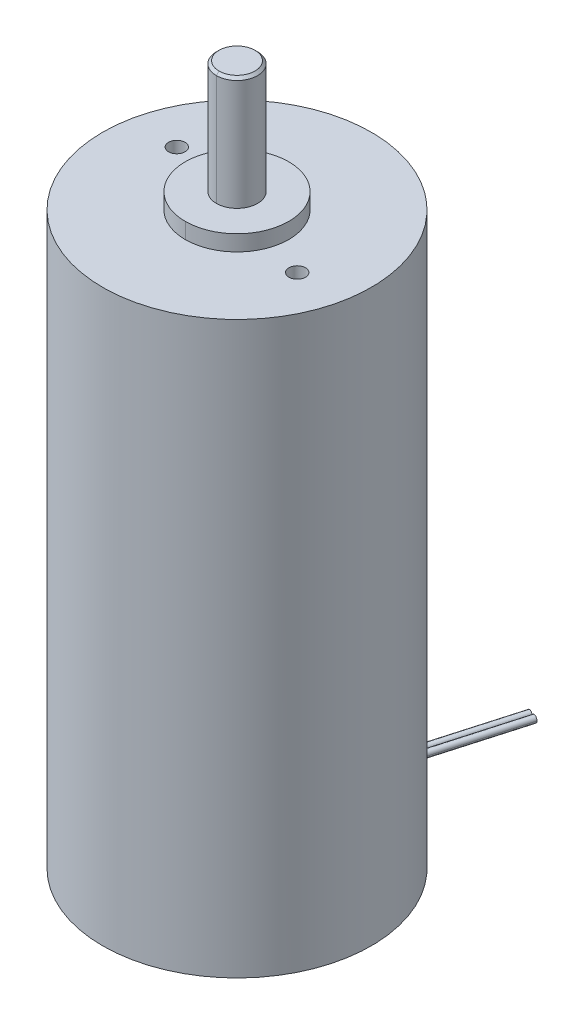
ISO-10303-21;
HEADER;
FILE_DESCRIPTION(('STEP AP214'),'2;1');
FILE_NAME('part.step','',(''),(''),'','','');
FILE_SCHEMA(('AUTOMOTIVE_DESIGN { 1 0 10303 214 1 1 1 1 }'));
ENDSEC;
DATA;
#1=APPLICATION_CONTEXT('core data for automotive mechanical design processes');
#2=APPLICATION_PROTOCOL_DEFINITION('international standard','automotive_design',2000,#1);
#3=PRODUCT_CONTEXT('',#1,'mechanical');
#4=PRODUCT('Part','Part','',(#3));
#5=PRODUCT_RELATED_PRODUCT_CATEGORY('part','',(#4));
#6=PRODUCT_DEFINITION_FORMATION('','',#4);
#7=PRODUCT_DEFINITION_CONTEXT('part definition',#1,'design');
#8=PRODUCT_DEFINITION('design','',#6,#7);
#9=PRODUCT_DEFINITION_SHAPE('','',#8);
#10=(LENGTH_UNIT() NAMED_UNIT(*) SI_UNIT(.MILLI.,.METRE.));
#11=(NAMED_UNIT(*) PLANE_ANGLE_UNIT() SI_UNIT($,.RADIAN.));
#12=(NAMED_UNIT(*) SI_UNIT($,.STERADIAN.) SOLID_ANGLE_UNIT());
#13=UNCERTAINTY_MEASURE_WITH_UNIT(LENGTH_MEASURE(1.E-05),#10,'distance_accuracy_value','');
#14=(GEOMETRIC_REPRESENTATION_CONTEXT(3) GLOBAL_UNCERTAINTY_ASSIGNED_CONTEXT((#13)) GLOBAL_UNIT_ASSIGNED_CONTEXT((#10,
#11,#12)) REPRESENTATION_CONTEXT('',''));
#15=CARTESIAN_POINT('',(0.,0.,0.));
#16=DIRECTION('',(0.,0.,1.));
#17=DIRECTION('',(1.,0.,0.));
#18=AXIS2_PLACEMENT_3D('',#15,#16,#17);
#19=CARTESIAN_POINT('',(0.,67.691,0.));
#20=DIRECTION('',(0.,1.,0.));
#21=DIRECTION('',(0.,0.,1.));
#22=AXIS2_PLACEMENT_3D('',#19,#20,#21);
#23=PLANE('',#22);
#24=CARTESIAN_POINT('',(0.,67.6910000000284,0.));
#25=DIRECTION('',(0.,-1.,0.));
#26=DIRECTION('',(0.,0.,-1.));
#27=AXIS2_PLACEMENT_3D('',#24,#25,#26);
#28=CIRCLE('',#27,1.74117000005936);
#29=CARTESIAN_POINT('',(0.,67.6910000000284,1.74117000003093));
#30=VERTEX_POINT('',#29);
#31=CARTESIAN_POINT('',(0.,67.6910000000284,-1.74117000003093));
#32=VERTEX_POINT('',#31);
#33=EDGE_CURVE('E276',#30,#32,#28,.T.);
#34=ORIENTED_EDGE('',*,*,#33,.F.);
#35=CARTESIAN_POINT('',(0.,67.6910000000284,0.));
#36=DIRECTION('',(0.,-1.,0.));
#37=DIRECTION('',(0.,0.,-1.));
#38=AXIS2_PLACEMENT_3D('',#35,#36,#37);
#39=CIRCLE('',#38,1.74117000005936);
#40=EDGE_CURVE('E280',#32,#30,#39,.T.);
#41=ORIENTED_EDGE('',*,*,#40,.F.);
#42=EDGE_LOOP('',(#34,#41));
#43=FACE_BOUND('',#42,.T.);
#44=ADVANCED_FACE('F15',(#43),#23,.T.);
#45=CARTESIAN_POINT('',(0.,67.4370000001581,0.));
#46=DIRECTION('',(0.,-1.,0.));
#47=DIRECTION('',(0.,0.,-1.));
#48=AXIS2_PLACEMENT_3D('',#45,#46,#47);
#49=CONICAL_SURFACE('',#48,1.99516999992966,0.785398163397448);
#50=CARTESIAN_POINT('',(0.,67.437,0.));
#51=DIRECTION('',(0.,-1.,0.));
#52=DIRECTION('',(0.,0.,-1.));
#53=AXIS2_PLACEMENT_3D('',#50,#51,#52);
#54=CIRCLE('',#53,1.99517);
#55=CARTESIAN_POINT('',(0.,67.4370000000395,-1.99516999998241));
#56=VERTEX_POINT('',#55);
#57=CARTESIAN_POINT('',(0.,67.4370000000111,1.99516999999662));
#58=VERTEX_POINT('',#57);
#59=EDGE_CURVE('E286',#56,#58,#54,.T.);
#60=ORIENTED_EDGE('',*,*,#59,.F.);
#61=DIRECTION('',(0.,0.707106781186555,0.70710678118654));
#62=VECTOR('',#61,1.);
#63=CARTESIAN_POINT('',(0.,-498930.56783001,-499000.));
#64=LINE('',#63,#62);
#65=EDGE_CURVE('E277',#32,#56,#64,.F.);
#66=ORIENTED_EDGE('',*,*,#65,.F.);
#67=ORIENTED_EDGE('',*,*,#40,.T.);
#68=DIRECTION('',(0.,0.707106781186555,-0.70710678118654));
#69=VECTOR('',#68,1.);
#70=CARTESIAN_POINT('',(6.11098752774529E-11,-498930.56783001,499000.));
#71=LINE('',#70,#69);
#72=EDGE_CURVE('E273',#58,#30,#71,.T.);
#73=ORIENTED_EDGE('',*,*,#72,.F.);
#74=EDGE_LOOP('',(#60,#66,#67,#73));
#75=FACE_BOUND('',#74,.T.);
#76=ADVANCED_FACE('F229',(#75),#49,.T.);
#77=CARTESIAN_POINT('',(0.,67.4370000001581,0.));
#78=DIRECTION('',(0.,-1.,0.));
#79=DIRECTION('',(0.,0.,-1.));
#80=AXIS2_PLACEMENT_3D('',#77,#78,#79);
#81=CONICAL_SURFACE('',#80,1.99516999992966,0.785398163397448);
#82=ORIENTED_EDGE('',*,*,#65,.T.);
#83=CARTESIAN_POINT('',(0.,67.437,0.));
#84=DIRECTION('',(0.,-1.,0.));
#85=DIRECTION('',(0.,0.,-1.));
#86=AXIS2_PLACEMENT_3D('',#83,#84,#85);
#87=CIRCLE('',#86,1.99517);
#88=EDGE_CURVE('E281',#58,#56,#87,.T.);
#89=ORIENTED_EDGE('',*,*,#88,.F.);
#90=ORIENTED_EDGE('',*,*,#72,.T.);
#91=ORIENTED_EDGE('',*,*,#33,.T.);
#92=EDGE_LOOP('',(#82,#89,#90,#91));
#93=FACE_BOUND('',#92,.T.);
#94=ADVANCED_FACE('F233',(#93),#81,.T.);
#95=CARTESIAN_POINT('',(0.,67.691,0.));
#96=DIRECTION('',(0.,-1.,0.));
#97=DIRECTION('',(0.,0.,-1.));
#98=AXIS2_PLACEMENT_3D('',#95,#96,#97);
#99=CYLINDRICAL_SURFACE('',#98,1.99517);
#100=CARTESIAN_POINT('',(0.,56.7182,0.));
#101=DIRECTION('',(0.,-1.,0.));
#102=DIRECTION('',(0.,0.,-1.));
#103=AXIS2_PLACEMENT_3D('',#100,#101,#102);
#104=CIRCLE('',#103,1.99517);
#105=CARTESIAN_POINT('',(0.,56.7182,-1.99517));
#106=VERTEX_POINT('',#105);
#107=CARTESIAN_POINT('',(0.,56.7182,1.99517));
#108=VERTEX_POINT('',#107);
#109=EDGE_CURVE('E284',#106,#108,#104,.T.);
#110=ORIENTED_EDGE('',*,*,#109,.F.);
#111=DIRECTION('',(0.,-1.,0.));
#112=VECTOR('',#111,1.);
#113=CARTESIAN_POINT('',(0.,67.691,-1.99517));
#114=LINE('',#113,#112);
#115=EDGE_CURVE('E289',#56,#106,#114,.T.);
#116=ORIENTED_EDGE('',*,*,#115,.F.);
#117=ORIENTED_EDGE('',*,*,#59,.T.);
#118=DIRECTION('',(0.,-1.,0.));
#119=VECTOR('',#118,1.);
#120=CARTESIAN_POINT('',(0.,67.691,1.99517));
#121=LINE('',#120,#119);
#122=EDGE_CURVE('E285',#108,#58,#121,.F.);
#123=ORIENTED_EDGE('',*,*,#122,.F.);
#124=EDGE_LOOP('',(#110,#116,#117,#123));
#125=FACE_BOUND('',#124,.T.);
#126=ADVANCED_FACE('F237',(#125),#99,.T.);
#127=CARTESIAN_POINT('',(0.,67.691,0.));
#128=DIRECTION('',(0.,-1.,0.));
#129=DIRECTION('',(0.,0.,-1.));
#130=AXIS2_PLACEMENT_3D('',#127,#128,#129);
#131=CYLINDRICAL_SURFACE('',#130,1.99517);
#132=ORIENTED_EDGE('',*,*,#115,.T.);
#133=CARTESIAN_POINT('',(0.,56.7182,0.));
#134=DIRECTION('',(0.,-1.,0.));
#135=DIRECTION('',(0.,0.,-1.));
#136=AXIS2_PLACEMENT_3D('',#133,#134,#135);
#137=CIRCLE('',#136,1.99517);
#138=EDGE_CURVE('E296',#108,#106,#137,.T.);
#139=ORIENTED_EDGE('',*,*,#138,.F.);
#140=ORIENTED_EDGE('',*,*,#122,.T.);
#141=ORIENTED_EDGE('',*,*,#88,.T.);
#142=EDGE_LOOP('',(#132,#139,#140,#141));
#143=FACE_BOUND('',#142,.T.);
#144=ADVANCED_FACE('F241',(#143),#131,.T.);
#145=CARTESIAN_POINT('',(0.,56.7182,0.));
#146=DIRECTION('',(0.,1.,0.));
#147=DIRECTION('',(0.,0.,1.));
#148=AXIS2_PLACEMENT_3D('',#145,#146,#147);
#149=PLANE('',#148);
#150=ORIENTED_EDGE('',*,*,#109,.T.);
#151=ORIENTED_EDGE('',*,*,#138,.T.);
#152=EDGE_LOOP('',(#150,#151));
#153=FACE_BOUND('',#152,.T.);
#154=CARTESIAN_POINT('',(0.,56.7182,0.));
#155=DIRECTION('',(0.,-1.,0.));
#156=DIRECTION('',(0.,0.,-1.));
#157=AXIS2_PLACEMENT_3D('',#154,#155,#156);
#158=CIRCLE('',#157,5.0038);
#159=CARTESIAN_POINT('',(0.,56.7182,5.0038));
#160=VERTEX_POINT('',#159);
#161=CARTESIAN_POINT('',(0.,56.7182,-5.0038));
#162=VERTEX_POINT('',#161);
#163=EDGE_CURVE('E264',#160,#162,#158,.T.);
#164=ORIENTED_EDGE('',*,*,#163,.F.);
#165=CARTESIAN_POINT('',(0.,56.7182,0.));
#166=DIRECTION('',(0.,-1.,0.));
#167=DIRECTION('',(0.,0.,-1.));
#168=AXIS2_PLACEMENT_3D('',#165,#166,#167);
#169=CIRCLE('',#168,5.0038);
#170=EDGE_CURVE('E266',#162,#160,#169,.T.);
#171=ORIENTED_EDGE('',*,*,#170,.F.);
#172=EDGE_LOOP('',(#164,#171));
#173=FACE_BOUND('',#172,.T.);
#174=ADVANCED_FACE('F245',(#153,#173),#149,.T.);
#175=CARTESIAN_POINT('',(0.,56.7182,0.));
#176=DIRECTION('',(0.,-1.,0.));
#177=DIRECTION('',(0.,0.,-1.));
#178=AXIS2_PLACEMENT_3D('',#175,#176,#177);
#179=CYLINDRICAL_SURFACE('',#178,5.0038);
#180=DIRECTION('',(0.,-1.,0.));
#181=VECTOR('',#180,1.);
#182=CARTESIAN_POINT('',(0.,56.7182,-5.0038));
#183=LINE('',#182,#181);
#184=CARTESIAN_POINT('',(0.,55.1942,-5.0038));
#185=VERTEX_POINT('',#184);
#186=EDGE_CURVE('E260',#185,#162,#183,.F.);
#187=ORIENTED_EDGE('',*,*,#186,.F.);
#188=CARTESIAN_POINT('',(0.,55.1942,0.));
#189=DIRECTION('',(0.,-1.,0.));
#190=DIRECTION('',(0.,0.,-1.));
#191=AXIS2_PLACEMENT_3D('',#188,#189,#190);
#192=CIRCLE('',#191,5.0038);
#193=CARTESIAN_POINT('',(0.,55.1942,5.0038));
#194=VERTEX_POINT('',#193);
#195=EDGE_CURVE('E24',#194,#185,#192,.T.);
#196=ORIENTED_EDGE('',*,*,#195,.F.);
#197=DIRECTION('',(0.,-1.,0.));
#198=VECTOR('',#197,1.);
#199=CARTESIAN_POINT('',(0.,56.7182,5.0038));
#200=LINE('',#199,#198);
#201=EDGE_CURVE('E19',#160,#194,#200,.T.);
#202=ORIENTED_EDGE('',*,*,#201,.F.);
#203=ORIENTED_EDGE('',*,*,#163,.T.);
#204=EDGE_LOOP('',(#187,#196,#202,#203));
#205=FACE_BOUND('',#204,.T.);
#206=ADVANCED_FACE('F248',(#205),#179,.T.);
#207=CARTESIAN_POINT('',(0.,56.7182,0.));
#208=DIRECTION('',(0.,-1.,0.));
#209=DIRECTION('',(0.,0.,-1.));
#210=AXIS2_PLACEMENT_3D('',#207,#208,#209);
#211=CYLINDRICAL_SURFACE('',#210,5.0038);
#212=CARTESIAN_POINT('',(0.,55.1942,0.));
#213=DIRECTION('',(0.,-1.,0.));
#214=DIRECTION('',(0.,0.,-1.));
#215=AXIS2_PLACEMENT_3D('',#212,#213,#214);
#216=CIRCLE('',#215,5.0038);
#217=EDGE_CURVE('E9',#185,#194,#216,.T.);
#218=ORIENTED_EDGE('',*,*,#217,.F.);
#219=ORIENTED_EDGE('',*,*,#186,.T.);
#220=ORIENTED_EDGE('',*,*,#170,.T.);
#221=ORIENTED_EDGE('',*,*,#201,.T.);
#222=EDGE_LOOP('',(#218,#219,#220,#221));
#223=FACE_BOUND('',#222,.T.);
#224=ADVANCED_FACE('F17',(#223),#211,.T.);
#225=CARTESIAN_POINT('',(0.,91.9773290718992,0.));
#226=DIRECTION('',(0.,-1.,0.));
#227=DIRECTION('',(0.,0.,-1.));
#228=AXIS2_PLACEMENT_3D('',#225,#226,#227);
#229=CYLINDRICAL_SURFACE('',#228,13.0048);
#230=CARTESIAN_POINT('',(0.,0.,0.));
#231=DIRECTION('',(0.,1.,0.));
#232=DIRECTION('',(0.,0.,1.));
#233=AXIS2_PLACEMENT_3D('',#230,#231,#232);
#234=CIRCLE('',#233,13.0048);
#235=CARTESIAN_POINT('',(0.,0.,13.0048));
#236=VERTEX_POINT('',#235);
#237=EDGE_CURVE('E309',#236,#236,#234,.F.);
#238=ORIENTED_EDGE('',*,*,#237,.F.);
#239=EDGE_LOOP('',(#238));
#240=FACE_BOUND('',#239,.T.);
#241=CARTESIAN_POINT('',(0.,55.1942,0.));
#242=DIRECTION('',(0.,1.,0.));
#243=DIRECTION('',(-1.,0.,0.));
#244=AXIS2_PLACEMENT_3D('',#241,#242,#243);
#245=CIRCLE('',#244,13.0048);
#246=CARTESIAN_POINT('',(-13.0048,55.1942,0.));
#247=VERTEX_POINT('',#246);
#248=EDGE_CURVE('E306',#247,#247,#245,.T.);
#249=ORIENTED_EDGE('',*,*,#248,.F.);
#250=EDGE_LOOP('',(#249));
#251=FACE_BOUND('',#250,.T.);
#252=CARTESIAN_POINT('',(3.57606223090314,4.82599999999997,-12.503463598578));
#253=CARTESIAN_POINT('',(3.57607669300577,4.84407572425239,-12.5034583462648));
#254=CARTESIAN_POINT('',(3.57459659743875,4.86214686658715,-12.503882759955));
#255=CARTESIAN_POINT('',(3.56875385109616,4.89776514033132,-12.5055521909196));
#256=CARTESIAN_POINT('',(3.56439330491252,4.91531264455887,-12.5067966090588));
#257=CARTESIAN_POINT('',(3.55289326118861,4.94940456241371,-12.5100681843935));
#258=CARTESIAN_POINT('',(3.54575247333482,4.96594850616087,-12.5120957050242));
#259=CARTESIAN_POINT('',(3.52889708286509,4.99755234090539,-12.5168600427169));
#260=CARTESIAN_POINT('',(3.51918298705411,5.01261252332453,-12.5195967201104));
#261=CARTESIAN_POINT('',(3.49745010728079,5.04082476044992,-12.5256853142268));
#262=CARTESIAN_POINT('',(3.48543133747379,5.05397682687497,-12.5290372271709));
#263=CARTESIAN_POINT('',(3.45942350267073,5.07800147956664,-12.5362432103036));
#264=CARTESIAN_POINT('',(3.44543414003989,5.08887372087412,-12.5400973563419));
#265=CARTESIAN_POINT('',(3.41588114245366,5.10802613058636,-12.5481796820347));
#266=CARTESIAN_POINT('',(3.40031774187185,5.11630668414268,-12.5524078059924));
#267=CARTESIAN_POINT('',(3.36805398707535,5.13004274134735,-12.5611032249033));
#268=CARTESIAN_POINT('',(3.35135370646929,5.13549842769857,-12.5655705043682));
#269=CARTESIAN_POINT('',(3.31728637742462,5.14343142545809,-12.5746071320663));
#270=CARTESIAN_POINT('',(3.29991931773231,5.14590868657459,-12.5791764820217));
#271=CARTESIAN_POINT('',(3.26500983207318,5.14781531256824,-12.5882826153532));
#272=CARTESIAN_POINT('',(3.24746740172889,5.1472446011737,-12.5928193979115));
#273=CARTESIAN_POINT('',(3.21269899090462,5.1430715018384,-12.6017344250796));
#274=CARTESIAN_POINT('',(3.19547312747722,5.13946801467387,-12.6061126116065));
#275=CARTESIAN_POINT('',(3.16183459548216,5.1293308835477,-12.61459179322));
#276=CARTESIAN_POINT('',(3.14542192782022,5.12279723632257,-12.6186927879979));
#277=CARTESIAN_POINT('',(3.11386797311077,5.10698023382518,-12.6265163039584));
#278=CARTESIAN_POINT('',(3.09872749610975,5.09769514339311,-12.6302385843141));
#279=CARTESIAN_POINT('',(3.0701640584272,5.07664037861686,-12.6372122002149));
#280=CARTESIAN_POINT('',(3.05674101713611,5.06487082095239,-12.6404635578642));
#281=CARTESIAN_POINT('',(3.03199721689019,5.03917969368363,-12.6464215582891));
#282=CARTESIAN_POINT('',(3.02067653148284,5.02525804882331,-12.6491281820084));
#283=CARTESIAN_POINT('',(3.00046228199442,4.99565222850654,-12.6539384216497));
#284=CARTESIAN_POINT('',(2.99156948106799,4.97996750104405,-12.6560418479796));
#285=CARTESIAN_POINT('',(2.97647426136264,4.94728793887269,-12.6596004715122));
#286=CARTESIAN_POINT('',(2.97027155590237,4.93029324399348,-12.6610557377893));
#287=CARTESIAN_POINT('',(2.96074656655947,4.89549590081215,-12.6632866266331));
#288=CARTESIAN_POINT('',(2.95741985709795,4.87769453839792,-12.6640632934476));
#289=CARTESIAN_POINT('',(2.95441213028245,4.84853222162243,-12.6647649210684));
#290=CARTESIAN_POINT('',(2.95383117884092,4.83726315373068,-12.6649001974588));
#291=CARTESIAN_POINT('',(2.95383597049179,4.82600000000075,-12.6648993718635));
#292=B_SPLINE_CURVE_WITH_KNOTS('',3,(#252,#253,#254,#255,#256,#257,#258,#259,#260,#261,#262,
#263,#264,#265,#266,#267,#268,#269,#270,#271,#272,#273,#274,#275,#276,#277,#278,#279,#280,#281,
#282,#283,#284,#285,#286,#287,#288,#289,#290,#291),.UNSPECIFIED.,.F.,.F.,(4,2,2,2,2,2,2,2,2,2,2,
2,2,2,2,2,2,2,2,4),(0.,0.0541551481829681,0.108270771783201,0.162411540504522,0.216541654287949,
0.270671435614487,0.324809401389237,0.378939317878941,0.433065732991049,0.487193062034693,
0.541321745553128,0.595470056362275,0.64961842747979,0.703801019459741,0.757981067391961,
0.812163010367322,0.866361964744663,0.920555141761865,0.974664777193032,1.0084541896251),.UNSPECIFIED.);
#293=CARTESIAN_POINT('',(3.57606223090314,4.82600000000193,-12.503463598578));
#294=VERTEX_POINT('',#293);
#295=CARTESIAN_POINT('',(2.95383597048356,4.82600000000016,-12.6648993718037));
#296=VERTEX_POINT('',#295);
#297=EDGE_CURVE('E140',#294,#296,#292,.T.);
#298=ORIENTED_EDGE('',*,*,#297,.T.);
#299=CARTESIAN_POINT('',(2.95383597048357,4.82600000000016,-12.6648993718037));
#300=CARTESIAN_POINT('',(2.95382064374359,4.80793823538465,-12.6649018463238));
#301=CARTESIAN_POINT('',(2.95532007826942,4.7898812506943,-12.6645532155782));
#302=CARTESIAN_POINT('',(2.96123527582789,4.75429206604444,-12.6631720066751));
#303=CARTESIAN_POINT('',(2.96564877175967,4.73675946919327,-12.662139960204));
#304=CARTESIAN_POINT('',(2.97728181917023,4.70269704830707,-12.6594095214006));
#305=CARTESIAN_POINT('',(2.98450262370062,4.68616767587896,-12.6577108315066));
#306=CARTESIAN_POINT('',(3.00153406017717,4.6545904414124,-12.6536829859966));
#307=CARTESIAN_POINT('',(3.01134422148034,4.6395423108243,-12.6513539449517));
#308=CARTESIAN_POINT('',(3.03328070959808,4.61133936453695,-12.6461123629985));
#309=CARTESIAN_POINT('',(3.04540868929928,4.59818591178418,-12.6431994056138));
#310=CARTESIAN_POINT('',(3.07162876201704,4.57415491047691,-12.6368548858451));
#311=CARTESIAN_POINT('',(3.08572116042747,4.56327771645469,-12.6334232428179));
#312=CARTESIAN_POINT('',(3.1154786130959,4.54410030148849,-12.6261177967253));
#313=CARTESIAN_POINT('',(3.13114511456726,4.53580248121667,-12.6222435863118));
#314=CARTESIAN_POINT('',(3.16359044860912,4.52203334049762,-12.6141506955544));
#315=CARTESIAN_POINT('',(3.18036921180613,4.51656184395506,-12.6099320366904));
#316=CARTESIAN_POINT('',(3.21456439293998,4.50859959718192,-12.6012582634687));
#317=CARTESIAN_POINT('',(3.23198092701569,4.5061093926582,-12.5968031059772));
#318=CARTESIAN_POINT('',(3.26695315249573,4.50418317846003,-12.5877784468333));
#319=CARTESIAN_POINT('',(3.28450884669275,4.50474723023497,-12.5832089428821));
#320=CARTESIAN_POINT('',(3.31925087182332,4.50891348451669,-12.5740891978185));
#321=CARTESIAN_POINT('',(3.33643739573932,4.51251405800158,-12.569538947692));
#322=CARTESIAN_POINT('',(3.36996414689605,4.5226497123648,-12.5605917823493));
#323=CARTESIAN_POINT('',(3.38630437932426,4.52918477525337,-12.5561948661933));
#324=CARTESIAN_POINT('',(3.41766968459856,4.54500031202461,-12.5476938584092));
#325=CARTESIAN_POINT('',(3.43269539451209,4.55427944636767,-12.5435896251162));
#326=CARTESIAN_POINT('',(3.46101749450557,4.57532059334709,-12.5358046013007));
#327=CARTESIAN_POINT('',(3.47431397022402,4.58708248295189,-12.5321237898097));
#328=CARTESIAN_POINT('',(3.49880285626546,4.6127521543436,-12.5253089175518));
#329=CARTESIAN_POINT('',(3.50999579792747,4.62665939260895,-12.5221747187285));
#330=CARTESIAN_POINT('',(3.52997224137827,4.656232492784,-12.5165581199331));
#331=CARTESIAN_POINT('',(3.53875497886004,4.67189891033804,-12.5140759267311));
#332=CARTESIAN_POINT('',(3.5536675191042,4.7045518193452,-12.5098493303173));
#333=CARTESIAN_POINT('',(3.55979544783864,4.72153923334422,-12.5081054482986));
#334=CARTESIAN_POINT('',(3.56920862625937,4.75632151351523,-12.505422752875));
#335=CARTESIAN_POINT('',(3.57249820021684,4.77411510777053,-12.5044827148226));
#336=CARTESIAN_POINT('',(3.57548737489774,4.8033354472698,-12.5036279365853));
#337=CARTESIAN_POINT('',(3.576066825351,4.81467068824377,-12.5034619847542));
#338=CARTESIAN_POINT('',(3.57606223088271,4.82600000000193,-12.5034635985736));
#339=B_SPLINE_CURVE_WITH_KNOTS('',3,(#299,#300,#301,#302,#303,#304,#305,#306,#307,#308,#309,
#310,#311,#312,#313,#314,#315,#316,#317,#318,#319,#320,#321,#322,#323,#324,#325,#326,#327,#328,
#329,#330,#331,#332,#333,#334,#335,#336,#337,#338),.UNSPECIFIED.,.F.,.F.,(4,2,2,2,2,2,2,2,2,2,2,
2,2,2,2,2,2,2,2,4),(0.,0.0541129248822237,0.108183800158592,0.162278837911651,0.216364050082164,
0.270487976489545,0.324620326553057,0.378802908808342,0.432982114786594,0.487171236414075,
0.541361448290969,0.595522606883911,0.649683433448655,0.703817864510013,0.757949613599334,
0.812067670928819,0.866202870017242,0.920376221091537,0.974466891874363,1.00845455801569),.UNSPECIFIED.);
#340=EDGE_CURVE('E141',#296,#294,#339,.T.);
#341=ORIENTED_EDGE('',*,*,#340,.T.);
#342=EDGE_LOOP('',(#298,#341));
#343=FACE_BOUND('',#342,.T.);
#344=CARTESIAN_POINT('',(3.59315346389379,4.82600000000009,-12.4985627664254));
#345=CARTESIAN_POINT('',(3.59313841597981,4.807924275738,-12.498565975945));
#346=CARTESIAN_POINT('',(3.5946185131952,4.78985313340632,-12.4981415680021));
#347=CARTESIAN_POINT('',(3.60045810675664,4.75423485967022,-12.4964611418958));
#348=CARTESIAN_POINT('',(3.60481550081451,4.73668735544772,-12.4952057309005));
#349=CARTESIAN_POINT('',(3.61630176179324,4.70259543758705,-12.4918860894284));
#350=CARTESIAN_POINT('',(3.62343191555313,4.68605149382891,-12.4898214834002));
#351=CARTESIAN_POINT('',(3.64025081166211,4.65444765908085,-12.4849298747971));
#352=CARTESIAN_POINT('',(3.64993905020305,4.63938747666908,-12.4821030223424));
#353=CARTESIAN_POINT('',(3.6715960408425,4.61117523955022,-12.4757497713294));
#354=CARTESIAN_POINT('',(3.68356477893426,4.59802317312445,-12.4722233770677));
#355=CARTESIAN_POINT('',(3.70943926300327,4.57399852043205,-12.4645523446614));
#356=CARTESIAN_POINT('',(3.72334530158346,4.56312627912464,-12.4604076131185));
#357=CARTESIAN_POINT('',(3.7526906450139,4.54397386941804,-12.4516011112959));
#358=CARTESIAN_POINT('',(3.76812972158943,4.53569331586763,-12.4469394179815));
#359=CARTESIAN_POINT('',(3.80009880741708,4.52195725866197,-12.4372163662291));
#360=CARTESIAN_POINT('',(3.81662874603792,4.5165015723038,-12.4321550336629));
#361=CARTESIAN_POINT('',(3.85030816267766,4.50856857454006,-12.4217655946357));
#362=CARTESIAN_POINT('',(3.86745765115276,4.50609131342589,-12.4164374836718));
#363=CARTESIAN_POINT('',(3.90188808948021,4.5041846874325,-12.4056607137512));
#364=CARTESIAN_POINT('',(3.91916904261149,4.50475539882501,-12.4002120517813));
#365=CARTESIAN_POINT('',(3.95337857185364,4.50892849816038,-12.3893479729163));
#366=CARTESIAN_POINT('',(3.97030701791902,4.51253198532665,-12.3839325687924));
#367=CARTESIAN_POINT('',(4.00332739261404,4.52266911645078,-12.3732976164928));
#368=CARTESIAN_POINT('',(4.01941932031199,4.52920276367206,-12.3680780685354));
#369=CARTESIAN_POINT('',(4.0503244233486,4.54501976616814,-12.3579917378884));
#370=CARTESIAN_POINT('',(4.06513678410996,4.55430485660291,-12.3531251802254));
#371=CARTESIAN_POINT('',(4.09305540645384,4.57535962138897,-12.3439028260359));
#372=CARTESIAN_POINT('',(4.10616174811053,4.5871291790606,-12.3395470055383));
#373=CARTESIAN_POINT('',(4.13030294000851,4.61282030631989,-12.3314874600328));
#374=CARTESIAN_POINT('',(4.14133771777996,4.6267419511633,-12.3277837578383));
#375=CARTESIAN_POINT('',(4.1610294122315,4.65634777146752,-12.3211511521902));
#376=CARTESIAN_POINT('',(4.16968558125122,4.67203249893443,-12.3182224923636));
#377=CARTESIAN_POINT('',(4.18437283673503,4.70471206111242,-12.31324112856));
#378=CARTESIAN_POINT('',(4.19040420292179,4.72170675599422,-12.3111883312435));
#379=CARTESIAN_POINT('',(4.19966404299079,4.75650409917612,-12.3080327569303));
#380=CARTESIAN_POINT('',(4.20289682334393,4.77430546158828,-12.3069285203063));
#381=CARTESIAN_POINT('',(4.20581932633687,4.80346777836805,-12.3059296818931));
#382=CARTESIAN_POINT('',(4.20638368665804,4.81473684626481,-12.3057365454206));
#383=CARTESIAN_POINT('',(4.20637918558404,4.82600000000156,-12.3057383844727));
#384=B_SPLINE_CURVE_WITH_KNOTS('',3,(#344,#345,#346,#347,#348,#349,#350,#351,#352,#353,#354,
#355,#356,#357,#358,#359,#360,#361,#362,#363,#364,#365,#366,#367,#368,#369,#370,#371,#372,#373,
#374,#375,#376,#377,#378,#379,#380,#381,#382,#383),.UNSPECIFIED.,.F.,.F.,(4,2,2,2,2,2,2,2,2,2,2,
2,2,2,2,2,2,2,2,4),(0.,0.0541551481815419,0.108270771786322,0.162411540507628,0.216541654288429,
0.270671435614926,0.324809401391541,0.378939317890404,0.433065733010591,0.487193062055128,
0.541321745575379,0.595470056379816,0.649618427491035,0.703801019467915,0.7579810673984,
0.812163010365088,0.866361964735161,0.920555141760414,0.974664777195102,1.00845418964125),.UNSPECIFIED.);
#385=CARTESIAN_POINT('',(3.59315346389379,4.82599999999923,-12.4985627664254));
#386=VERTEX_POINT('',#385);
#387=CARTESIAN_POINT('',(4.20637918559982,4.82600000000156,-12.3057383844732));
#388=VERTEX_POINT('',#387);
#389=EDGE_CURVE('E184',#386,#388,#384,.T.);
#390=ORIENTED_EDGE('',*,*,#389,.T.);
#391=CARTESIAN_POINT('',(4.20637918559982,4.826,-12.3057383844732));
#392=CARTESIAN_POINT('',(4.20639349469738,4.84406176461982,-12.3057323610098));
#393=CARTESIAN_POINT('',(4.20493715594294,4.86211874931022,-12.306231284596));
#394=CARTESIAN_POINT('',(4.19918885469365,4.89770793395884,-12.3081945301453));
#395=CARTESIAN_POINT('',(4.19489909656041,4.91524053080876,-12.3096581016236));
#396=CARTESIAN_POINT('',(4.18358680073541,4.94930295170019,-12.3135071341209));
#397=CARTESIAN_POINT('',(4.1765630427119,4.96583232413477,-12.3158930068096));
#398=CARTESIAN_POINT('',(4.15998513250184,4.99740955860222,-12.3215024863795));
#399=CARTESIAN_POINT('',(4.15043144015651,5.0124576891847,-12.3247259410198));
#400=CARTESIAN_POINT('',(4.12905062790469,5.04066063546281,-12.331905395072));
#401=CARTESIAN_POINT('',(4.11722188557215,5.05381408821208,-12.3358619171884));
#402=CARTESIAN_POINT('',(4.09162391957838,5.0778450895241,-12.3443759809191));
#403=CARTESIAN_POINT('',(4.0778543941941,5.08872228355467,-12.3489336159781));
#404=CARTESIAN_POINT('',(4.04874734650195,5.10789969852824,-12.3585072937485));
#405=CARTESIAN_POINT('',(4.03340838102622,5.11619751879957,-12.3635237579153));
#406=CARTESIAN_POINT('',(4.00160459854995,5.12996665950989,-12.3738540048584));
#407=CARTESIAN_POINT('',(3.98513985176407,5.13543815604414,-12.3791677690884));
#408=CARTESIAN_POINT('',(3.95154429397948,5.14340040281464,-12.3899326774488));
#409=CARTESIAN_POINT('',(3.93441336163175,5.14589060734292,-12.395383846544));
#410=CARTESIAN_POINT('',(3.89997289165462,5.14781682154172,-12.4062629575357));
#411=CARTESIAN_POINT('',(3.88266335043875,5.14725276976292,-12.4116908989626));
#412=CARTESIAN_POINT('',(3.84836771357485,5.1430865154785,-12.4223673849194));
#413=CARTESIAN_POINT('',(3.83138144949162,5.13948594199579,-12.4276160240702));
#414=CARTESIAN_POINT('',(3.79820787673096,5.12935028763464,-12.4377948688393));
#415=CARTESIAN_POINT('',(3.78202056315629,5.12281522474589,-12.4427250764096));
#416=CARTESIAN_POINT('',(3.75091642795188,5.10699968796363,-12.4521368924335));
#417=CARTESIAN_POINT('',(3.73599899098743,5.09772055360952,-12.4566187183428));
#418=CARTESIAN_POINT('',(3.70785505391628,5.07667940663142,-12.4650250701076));
#419=CARTESIAN_POINT('',(3.69462847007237,5.06491751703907,-12.4689496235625));
#420=CARTESIAN_POINT('',(3.67024938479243,5.03924784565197,-12.4761474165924));
#421=CARTESIAN_POINT('',(3.65909635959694,5.02534060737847,-12.4794208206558));
#422=CARTESIAN_POINT('',(3.63917903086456,4.9957675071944,-12.4852435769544));
#423=CARTESIAN_POINT('',(3.6304154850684,4.98010108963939,-12.4877926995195));
#424=CARTESIAN_POINT('',(3.61552917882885,4.94744818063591,-12.4921107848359));
#425=CARTESIAN_POINT('',(3.60940828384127,4.9304607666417,-12.4938791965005));
#426=CARTESIAN_POINT('',(3.60000384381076,4.89567848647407,-12.4965923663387));
#427=CARTESIAN_POINT('',(3.5967159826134,4.87788489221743,-12.4975383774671));
#428=CARTESIAN_POINT('',(3.5937280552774,4.84866455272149,-12.4983975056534));
#429=CARTESIAN_POINT('',(3.59314871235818,4.83732931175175,-12.4985638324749));
#430=CARTESIAN_POINT('',(3.59315346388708,4.82599999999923,-12.4985627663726));
#431=B_SPLINE_CURVE_WITH_KNOTS('',3,(#391,#392,#393,#394,#395,#396,#397,#398,#399,#400,#401,
#402,#403,#404,#405,#406,#407,#408,#409,#410,#411,#412,#413,#414,#415,#416,#417,#418,#419,#420,
#421,#422,#423,#424,#425,#426,#427,#428,#429,#430),.UNSPECIFIED.,.F.,.F.,(4,2,2,2,2,2,2,2,2,2,2,
2,2,2,2,2,2,2,2,4),(0.,0.0541129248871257,0.108183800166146,0.162278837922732,0.216364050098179,
0.270487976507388,0.32462032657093,0.378802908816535,0.432982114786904,0.48717123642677,
0.541361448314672,0.595522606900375,0.649683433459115,0.703817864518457,0.757949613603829,
0.812067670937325,0.866202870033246,0.920376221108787,0.974466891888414,1.00845455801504),.UNSPECIFIED.);
#432=EDGE_CURVE('E176',#388,#386,#431,.T.);
#433=ORIENTED_EDGE('',*,*,#432,.T.);
#434=EDGE_LOOP('',(#390,#433));
#435=FACE_BOUND('',#434,.T.);
#436=ADVANCED_FACE('F220',(#240,#251,#343,#435),#229,.T.);
#437=CARTESIAN_POINT('',(-19.05,55.1942,-15.));
#438=DIRECTION('',(0.,1.,0.));
#439=DIRECTION('',(-1.,0.,0.));
#440=AXIS2_PLACEMENT_3D('',#437,#438,#439);
#441=PLANE('',#440);
#442=CARTESIAN_POINT('',(-8.17072441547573,55.1942,-2.3429175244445));
#443=DIRECTION('',(0.,1.,0.));
#444=DIRECTION('',(0.,0.,1.));
#445=AXIS2_PLACEMENT_3D('',#442,#443,#444);
#446=CIRCLE('',#445,0.799999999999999);
#447=CARTESIAN_POINT('',(-8.17072441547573,55.1942,-1.5429175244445));
#448=VERTEX_POINT('',#447);
#449=EDGE_CURVE('E121',#448,#448,#446,.T.);
#450=ORIENTED_EDGE('',*,*,#449,.F.);
#451=EDGE_LOOP('',(#450));
#452=FACE_BOUND('',#451,.T.);
#453=CARTESIAN_POINT('',(8.1707244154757,55.1942,2.3429175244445));
#454=DIRECTION('',(0.,1.,0.));
#455=DIRECTION('',(0.,0.,1.));
#456=AXIS2_PLACEMENT_3D('',#453,#454,#455);
#457=CIRCLE('',#456,0.8);
#458=CARTESIAN_POINT('',(8.1707244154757,55.1942,3.1429175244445));
#459=VERTEX_POINT('',#458);
#460=EDGE_CURVE('E120',#459,#459,#457,.T.);
#461=ORIENTED_EDGE('',*,*,#460,.F.);
#462=EDGE_LOOP('',(#461));
#463=FACE_BOUND('',#462,.T.);
#464=ORIENTED_EDGE('',*,*,#217,.T.);
#465=ORIENTED_EDGE('',*,*,#195,.T.);
#466=EDGE_LOOP('',(#464,#465));
#467=FACE_BOUND('',#466,.T.);
#468=ORIENTED_EDGE('',*,*,#248,.T.);
#469=EDGE_LOOP('',(#468));
#470=FACE_BOUND('',#469,.T.);
#471=ADVANCED_FACE('F218',(#452,#463,#467,#470),#441,.T.);
#472=CARTESIAN_POINT('',(0.,0.,0.));
#473=DIRECTION('',(0.,1.,0.));
#474=DIRECTION('',(0.,0.,1.));
#475=AXIS2_PLACEMENT_3D('',#472,#473,#474);
#476=PLANE('',#475);
#477=CARTESIAN_POINT('',(0.,0.,0.));
#478=DIRECTION('',(0.,1.,0.));
#479=DIRECTION('',(0.,0.,1.));
#480=AXIS2_PLACEMENT_3D('',#477,#478,#479);
#481=CIRCLE('',#480,1.98501);
#482=CARTESIAN_POINT('',(0.,0.,-1.98501));
#483=VERTEX_POINT('',#482);
#484=CARTESIAN_POINT('',(0.,0.,1.98501));
#485=VERTEX_POINT('',#484);
#486=EDGE_CURVE('E319',#483,#485,#481,.F.);
#487=ORIENTED_EDGE('',*,*,#486,.F.);
#488=CARTESIAN_POINT('',(0.,0.,0.));
#489=DIRECTION('',(0.,1.,0.));
#490=DIRECTION('',(0.,0.,1.));
#491=AXIS2_PLACEMENT_3D('',#488,#489,#490);
#492=CIRCLE('',#491,1.98501);
#493=EDGE_CURVE('E312',#485,#483,#492,.F.);
#494=ORIENTED_EDGE('',*,*,#493,.F.);
#495=EDGE_LOOP('',(#487,#494));
#496=FACE_BOUND('',#495,.T.);
#497=ORIENTED_EDGE('',*,*,#237,.T.);
#498=EDGE_LOOP('',(#497));
#499=FACE_BOUND('',#498,.T.);
#500=ADVANCED_FACE('F202',(#496,#499),#476,.F.);
#501=CARTESIAN_POINT('',(0.,-1.27,0.));
#502=DIRECTION('',(0.,1.,0.));
#503=DIRECTION('',(0.,0.,1.));
#504=AXIS2_PLACEMENT_3D('',#501,#502,#503);
#505=CYLINDRICAL_SURFACE('',#504,1.98501);
#506=ORIENTED_EDGE('',*,*,#486,.T.);
#507=DIRECTION('',(0.,1.,0.));
#508=VECTOR('',#507,1.);
#509=CARTESIAN_POINT('',(0.,-1.27,1.98501));
#510=LINE('',#509,#508);
#511=CARTESIAN_POINT('',(0.,-1.01600000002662,1.98500999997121));
#512=VERTEX_POINT('',#511);
#513=EDGE_CURVE('E321',#512,#485,#510,.T.);
#514=ORIENTED_EDGE('',*,*,#513,.F.);
#515=CARTESIAN_POINT('',(0.,-1.016,0.));
#516=DIRECTION('',(0.,1.,0.));
#517=DIRECTION('',(0.,0.,1.));
#518=AXIS2_PLACEMENT_3D('',#515,#516,#517);
#519=CIRCLE('',#518,1.98501);
#520=CARTESIAN_POINT('',(0.,-1.01600000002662,-1.98500999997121));
#521=VERTEX_POINT('',#520);
#522=EDGE_CURVE('E327',#512,#521,#519,.T.);
#523=ORIENTED_EDGE('',*,*,#522,.T.);
#524=DIRECTION('',(0.,1.,0.));
#525=VECTOR('',#524,1.);
#526=CARTESIAN_POINT('',(0.,-1.27,-1.98501));
#527=LINE('',#526,#525);
#528=EDGE_CURVE('E331',#483,#521,#527,.F.);
#529=ORIENTED_EDGE('',*,*,#528,.F.);
#530=EDGE_LOOP('',(#506,#514,#523,#529));
#531=FACE_BOUND('',#530,.T.);
#532=ADVANCED_FACE('F198',(#531),#505,.T.);
#533=CARTESIAN_POINT('',(0.,-1.27,0.));
#534=DIRECTION('',(0.,1.,0.));
#535=DIRECTION('',(0.,0.,1.));
#536=AXIS2_PLACEMENT_3D('',#533,#534,#535);
#537=CYLINDRICAL_SURFACE('',#536,1.98501);
#538=ORIENTED_EDGE('',*,*,#513,.T.);
#539=ORIENTED_EDGE('',*,*,#493,.T.);
#540=ORIENTED_EDGE('',*,*,#528,.T.);
#541=CARTESIAN_POINT('',(0.,-1.016,0.));
#542=DIRECTION('',(0.,1.,0.));
#543=DIRECTION('',(0.,0.,1.));
#544=AXIS2_PLACEMENT_3D('',#541,#542,#543);
#545=CIRCLE('',#544,1.98501);
#546=EDGE_CURVE('E328',#521,#512,#545,.T.);
#547=ORIENTED_EDGE('',*,*,#546,.T.);
#548=EDGE_LOOP('',(#538,#539,#540,#547));
#549=FACE_BOUND('',#548,.T.);
#550=ADVANCED_FACE('F193',(#549),#537,.T.);
#551=CARTESIAN_POINT('',(0.,-1.01600000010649,0.));
#552=DIRECTION('',(0.,1.,0.));
#553=DIRECTION('',(0.,0.,1.));
#554=AXIS2_PLACEMENT_3D('',#551,#552,#553);
#555=CONICAL_SURFACE('',#554,1.98500999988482,0.785398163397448);
#556=ORIENTED_EDGE('',*,*,#522,.F.);
#557=DIRECTION('',(0.,-0.707106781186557,-0.707106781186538));
#558=VECTOR('',#557,1.);
#559=CARTESIAN_POINT('',(0.,498996.998990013,499000.));
#560=LINE('',#559,#558);
#561=CARTESIAN_POINT('',(0.,-1.26999999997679,1.73101000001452));
#562=VERTEX_POINT('',#561);
#563=EDGE_CURVE('E318',#562,#512,#560,.F.);
#564=ORIENTED_EDGE('',*,*,#563,.F.);
#565=CARTESIAN_POINT('',(0.,-1.26999999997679,0.));
#566=DIRECTION('',(0.,1.,0.));
#567=DIRECTION('',(0.,0.,1.));
#568=AXIS2_PLACEMENT_3D('',#565,#566,#567);
#569=CIRCLE('',#568,1.73101000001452);
#570=CARTESIAN_POINT('',(0.,-1.26999999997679,-1.73101000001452));
#571=VERTEX_POINT('',#570);
#572=EDGE_CURVE('E183',#562,#571,#569,.T.);
#573=ORIENTED_EDGE('',*,*,#572,.T.);
#574=DIRECTION('',(0.,-0.707106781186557,0.707106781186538));
#575=VECTOR('',#574,1.);
#576=CARTESIAN_POINT('',(6.11098752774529E-11,498996.998990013,-499000.));
#577=LINE('',#576,#575);
#578=EDGE_CURVE('E314',#521,#571,#577,.T.);
#579=ORIENTED_EDGE('',*,*,#578,.F.);
#580=EDGE_LOOP('',(#556,#564,#573,#579));
#581=FACE_BOUND('',#580,.T.);
#582=ADVANCED_FACE('F197',(#581),#555,.T.);
#583=CARTESIAN_POINT('',(0.,-1.01600000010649,0.));
#584=DIRECTION('',(0.,1.,0.));
#585=DIRECTION('',(0.,0.,1.));
#586=AXIS2_PLACEMENT_3D('',#583,#584,#585);
#587=CONICAL_SURFACE('',#586,1.98500999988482,0.785398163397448);
#588=ORIENTED_EDGE('',*,*,#563,.T.);
#589=ORIENTED_EDGE('',*,*,#546,.F.);
#590=ORIENTED_EDGE('',*,*,#578,.T.);
#591=CARTESIAN_POINT('',(0.,-1.26999999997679,0.));
#592=DIRECTION('',(0.,1.,0.));
#593=DIRECTION('',(0.,0.,1.));
#594=AXIS2_PLACEMENT_3D('',#591,#592,#593);
#595=CIRCLE('',#594,1.73101000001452);
#596=EDGE_CURVE('E315',#571,#562,#595,.T.);
#597=ORIENTED_EDGE('',*,*,#596,.T.);
#598=EDGE_LOOP('',(#588,#589,#590,#597));
#599=FACE_BOUND('',#598,.T.);
#600=ADVANCED_FACE('F204',(#599),#587,.T.);
#601=CARTESIAN_POINT('',(0.,-1.27,0.));
#602=DIRECTION('',(0.,-1.,0.));
#603=DIRECTION('',(0.,0.,-1.));
#604=AXIS2_PLACEMENT_3D('',#601,#602,#603);
#605=PLANE('',#604);
#606=ORIENTED_EDGE('',*,*,#596,.F.);
#607=ORIENTED_EDGE('',*,*,#572,.F.);
#608=EDGE_LOOP('',(#606,#607));
#609=FACE_BOUND('',#608,.T.);
#610=ADVANCED_FACE('F207',(#609),#605,.T.);
#611=CARTESIAN_POINT('',(6.0536732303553,4.826,-22.3096182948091));
#612=DIRECTION('',(0.275637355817,0.,-0.961261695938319));
#613=DIRECTION('',(-0.961261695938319,0.,-0.275637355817));
#614=AXIS2_PLACEMENT_3D('',#611,#612,#613);
#615=PLANE('',#614);
#616=CARTESIAN_POINT('',(6.0536732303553,4.826,-22.3096182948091));
#617=DIRECTION('',(0.275637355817,0.,-0.961261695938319));
#618=DIRECTION('',(-0.961261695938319,0.,-0.275637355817));
#619=AXIS2_PLACEMENT_3D('',#616,#617,#618);
#620=CIRCLE('',#619,0.32131);
#621=CARTESIAN_POINT('',(5.74481023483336,4.82600000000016,-22.3981833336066));
#622=VERTEX_POINT('',#621);
#623=CARTESIAN_POINT('',(6.36253622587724,4.82599999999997,-22.2210532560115));
#624=VERTEX_POINT('',#623);
#625=EDGE_CURVE('E131',#622,#624,#620,.T.);
#626=ORIENTED_EDGE('',*,*,#625,.T.);
#627=CARTESIAN_POINT('',(6.0536732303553,4.826,-22.3096182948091));
#628=DIRECTION('',(0.275637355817,0.,-0.961261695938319));
#629=DIRECTION('',(-0.961261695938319,0.,-0.275637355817));
#630=AXIS2_PLACEMENT_3D('',#627,#628,#629);
#631=CIRCLE('',#630,0.32131);
#632=EDGE_CURVE('E132',#624,#622,#631,.T.);
#633=ORIENTED_EDGE('',*,*,#632,.T.);
#634=EDGE_LOOP('',(#626,#633));
#635=FACE_BOUND('',#634,.T.);
#636=ADVANCED_FACE('F214',(#635),#615,.T.);
#637=CARTESIAN_POINT('',(-143373.061781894,4.826,500000.088565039));
#638=DIRECTION('',(0.275637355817,0.,-0.961261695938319));
#639=DIRECTION('',(-0.961261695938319,0.,-0.275637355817));
#640=AXIS2_PLACEMENT_3D('',#637,#638,#639);
#641=CYLINDRICAL_SURFACE('',#640,0.32131);
#642=ORIENTED_EDGE('',*,*,#297,.F.);
#643=DIRECTION('',(0.275637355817,0.,-0.961261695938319));
#644=VECTOR('',#643,1.);
#645=CARTESIAN_POINT('',(-143372.752918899,4.82599999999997,500000.177130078));
#646=LINE('',#645,#644);
#647=EDGE_CURVE('E138',#294,#624,#646,.T.);
#648=ORIENTED_EDGE('',*,*,#647,.T.);
#649=ORIENTED_EDGE('',*,*,#625,.F.);
#650=DIRECTION('',(0.275637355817,0.,-0.961261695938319));
#651=VECTOR('',#650,1.);
#652=CARTESIAN_POINT('',(-143373.37064489,4.82600000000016,500000.));
#653=LINE('',#652,#651);
#654=EDGE_CURVE('E40',#296,#622,#653,.T.);
#655=ORIENTED_EDGE('',*,*,#654,.F.);
#656=EDGE_LOOP('',(#642,#648,#649,#655));
#657=FACE_BOUND('',#656,.T.);
#658=ADVANCED_FACE('F160',(#657),#641,.T.);
#659=CARTESIAN_POINT('',(-143373.061781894,4.826,500000.088565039));
#660=DIRECTION('',(0.275637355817,0.,-0.961261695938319));
#661=DIRECTION('',(-0.961261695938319,0.,-0.275637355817));
#662=AXIS2_PLACEMENT_3D('',#659,#660,#661);
#663=CYLINDRICAL_SURFACE('',#662,0.32131);
#664=ORIENTED_EDGE('',*,*,#340,.F.);
#665=ORIENTED_EDGE('',*,*,#654,.T.);
#666=ORIENTED_EDGE('',*,*,#632,.F.);
#667=ORIENTED_EDGE('',*,*,#647,.F.);
#668=EDGE_LOOP('',(#664,#665,#666,#667));
#669=FACE_BOUND('',#668,.T.);
#670=ADVANCED_FACE('F155',(#669),#663,.T.);
#671=CARTESIAN_POINT('',(6.68849045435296,4.826,-22.1275873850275));
#672=DIRECTION('',(0.275637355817,0.,-0.961261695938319));
#673=DIRECTION('',(-0.961261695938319,0.,-0.275637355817));
#674=AXIS2_PLACEMENT_3D('',#671,#672,#673);
#675=PLANE('',#674);
#676=CARTESIAN_POINT('',(6.68849045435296,4.826,-22.1275873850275));
#677=DIRECTION('',(0.275637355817,0.,-0.961261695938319));
#678=DIRECTION('',(-0.961261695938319,0.,-0.275637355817));
#679=AXIS2_PLACEMENT_3D('',#676,#677,#678);
#680=CIRCLE('',#679,0.32131);
#681=CARTESIAN_POINT('',(6.9973534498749,4.826,-22.03902234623));
#682=VERTEX_POINT('',#681);
#683=CARTESIAN_POINT('',(6.37962745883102,4.82600000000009,-22.2161524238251));
#684=VERTEX_POINT('',#683);
#685=EDGE_CURVE('E149',#682,#684,#680,.T.);
#686=ORIENTED_EDGE('',*,*,#685,.T.);
#687=CARTESIAN_POINT('',(6.68849045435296,4.826,-22.1275873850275));
#688=DIRECTION('',(0.275637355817,0.,-0.961261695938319));
#689=DIRECTION('',(-0.961261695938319,0.,-0.275637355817));
#690=AXIS2_PLACEMENT_3D('',#687,#688,#689);
#691=CIRCLE('',#690,0.32131);
#692=EDGE_CURVE('E353',#684,#682,#691,.T.);
#693=ORIENTED_EDGE('',*,*,#692,.T.);
#694=EDGE_LOOP('',(#686,#693));
#695=FACE_BOUND('',#694,.T.);
#696=ADVANCED_FACE('F162',(#695),#675,.T.);
#697=CARTESIAN_POINT('',(-143372.323976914,4.826,499999.911434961));
#698=DIRECTION('',(0.275637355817,0.,-0.961261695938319));
#699=DIRECTION('',(-0.961261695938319,0.,-0.275637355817));
#700=AXIS2_PLACEMENT_3D('',#697,#698,#699);
#701=CYLINDRICAL_SURFACE('',#700,0.32131);
#702=ORIENTED_EDGE('',*,*,#432,.F.);
#703=DIRECTION('',(0.275637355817,0.,-0.961261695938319));
#704=VECTOR('',#703,1.);
#705=CARTESIAN_POINT('',(-143372.015113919,4.826,500000.));
#706=LINE('',#705,#704);
#707=EDGE_CURVE('E32',#388,#682,#706,.T.);
#708=ORIENTED_EDGE('',*,*,#707,.T.);
#709=ORIENTED_EDGE('',*,*,#692,.F.);
#710=DIRECTION('',(0.275637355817,0.,-0.961261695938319));
#711=VECTOR('',#710,1.);
#712=CARTESIAN_POINT('',(-143372.63283991,4.82600000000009,499999.822869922));
#713=LINE('',#712,#711);
#714=EDGE_CURVE('E185',#386,#684,#713,.T.);
#715=ORIENTED_EDGE('',*,*,#714,.F.);
#716=EDGE_LOOP('',(#702,#708,#709,#715));
#717=FACE_BOUND('',#716,.T.);
#718=ADVANCED_FACE('F166',(#717),#701,.T.);
#719=CARTESIAN_POINT('',(-143372.323976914,4.826,499999.911434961));
#720=DIRECTION('',(0.275637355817,0.,-0.961261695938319));
#721=DIRECTION('',(-0.961261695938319,0.,-0.275637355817));
#722=AXIS2_PLACEMENT_3D('',#719,#720,#721);
#723=CYLINDRICAL_SURFACE('',#722,0.32131);
#724=ORIENTED_EDGE('',*,*,#389,.F.);
#725=ORIENTED_EDGE('',*,*,#714,.T.);
#726=ORIENTED_EDGE('',*,*,#685,.F.);
#727=ORIENTED_EDGE('',*,*,#707,.F.);
#728=EDGE_LOOP('',(#724,#725,#726,#727));
#729=FACE_BOUND('',#728,.T.);
#730=ADVANCED_FACE('F171',(#729),#723,.T.);
#731=CARTESIAN_POINT('',(8.1707244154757,50.1142,2.3429175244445));
#732=DIRECTION('',(0.,1.,0.));
#733=DIRECTION('',(0.,0.,1.));
#734=AXIS2_PLACEMENT_3D('',#731,#732,#733);
#735=CONICAL_SURFACE('',#734,0.799999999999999,1.02974425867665);
#736=CARTESIAN_POINT('',(8.1707244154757,49.6335115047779,2.3429175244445));
#737=VERTEX_POINT('',#736);
#738=VERTEX_LOOP('',#737);
#739=FACE_BOUND('',#738,.T.);
#740=CARTESIAN_POINT('',(8.1707244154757,50.1142,2.3429175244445));
#741=DIRECTION('',(0.,1.,0.));
#742=DIRECTION('',(0.,0.,1.));
#743=AXIS2_PLACEMENT_3D('',#740,#741,#742);
#744=CIRCLE('',#743,0.799999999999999);
#745=CARTESIAN_POINT('',(8.1707244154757,50.1142,3.1429175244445));
#746=VERTEX_POINT('',#745);
#747=EDGE_CURVE('E124',#746,#746,#744,.T.);
#748=ORIENTED_EDGE('',*,*,#747,.T.);
#749=EDGE_LOOP('',(#748));
#750=FACE_BOUND('',#749,.T.);
#751=ADVANCED_FACE('F358',(#739,#750),#735,.F.);
#752=CARTESIAN_POINT('',(8.1707244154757,55.1942,2.3429175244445));
#753=DIRECTION('',(0.,1.,0.));
#754=DIRECTION('',(0.,0.,1.));
#755=AXIS2_PLACEMENT_3D('',#752,#753,#754);
#756=CYLINDRICAL_SURFACE('',#755,0.799999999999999);
#757=ORIENTED_EDGE('',*,*,#747,.F.);
#758=EDGE_LOOP('',(#757));
#759=FACE_BOUND('',#758,.T.);
#760=ORIENTED_EDGE('',*,*,#460,.T.);
#761=EDGE_LOOP('',(#760));
#762=FACE_BOUND('',#761,.T.);
#763=ADVANCED_FACE('F114',(#759,#762),#756,.F.);
#764=CARTESIAN_POINT('',(-8.17072441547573,50.1142,-2.3429175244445));
#765=DIRECTION('',(0.,1.,0.));
#766=DIRECTION('',(0.,0.,1.));
#767=AXIS2_PLACEMENT_3D('',#764,#765,#766);
#768=CONICAL_SURFACE('',#767,0.799999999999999,1.02974425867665);
#769=CARTESIAN_POINT('',(-8.17072441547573,49.6335115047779,-2.3429175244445));
#770=VERTEX_POINT('',#769);
#771=VERTEX_LOOP('',#770);
#772=FACE_BOUND('',#771,.T.);
#773=CARTESIAN_POINT('',(-8.17072441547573,50.1142,-2.3429175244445));
#774=DIRECTION('',(0.,1.,0.));
#775=DIRECTION('',(0.,0.,1.));
#776=AXIS2_PLACEMENT_3D('',#773,#774,#775);
#777=CIRCLE('',#776,0.799999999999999);
#778=CARTESIAN_POINT('',(-8.17072441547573,50.1142,-1.5429175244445));
#779=VERTEX_POINT('',#778);
#780=EDGE_CURVE('E118',#779,#779,#777,.T.);
#781=ORIENTED_EDGE('',*,*,#780,.T.);
#782=EDGE_LOOP('',(#781));
#783=FACE_BOUND('',#782,.T.);
#784=ADVANCED_FACE('F110',(#772,#783),#768,.F.);
#785=CARTESIAN_POINT('',(-8.17072441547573,55.1942,-2.3429175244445));
#786=DIRECTION('',(0.,1.,0.));
#787=DIRECTION('',(0.,0.,1.));
#788=AXIS2_PLACEMENT_3D('',#785,#786,#787);
#789=CYLINDRICAL_SURFACE('',#788,0.799999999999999);
#790=ORIENTED_EDGE('',*,*,#780,.F.);
#791=EDGE_LOOP('',(#790));
#792=FACE_BOUND('',#791,.T.);
#793=ORIENTED_EDGE('',*,*,#449,.T.);
#794=EDGE_LOOP('',(#793));
#795=FACE_BOUND('',#794,.T.);
#796=ADVANCED_FACE('F113',(#792,#795),#789,.F.);
#797=CLOSED_SHELL('',(#44,#76,#94,#126,#144,#174,#206,#224,#436,#471,#500,#532,#550,#582,#600,
#610,#636,#658,#670,#696,#718,#730,#751,#763,#784,#796));
#798=MANIFOLD_SOLID_BREP('B1',#797);
#799=ADVANCED_BREP_SHAPE_REPRESENTATION('',(#18,#798),#14);
#800=SHAPE_DEFINITION_REPRESENTATION(#9,#799);
ENDSEC;
END-ISO-10303-21;
